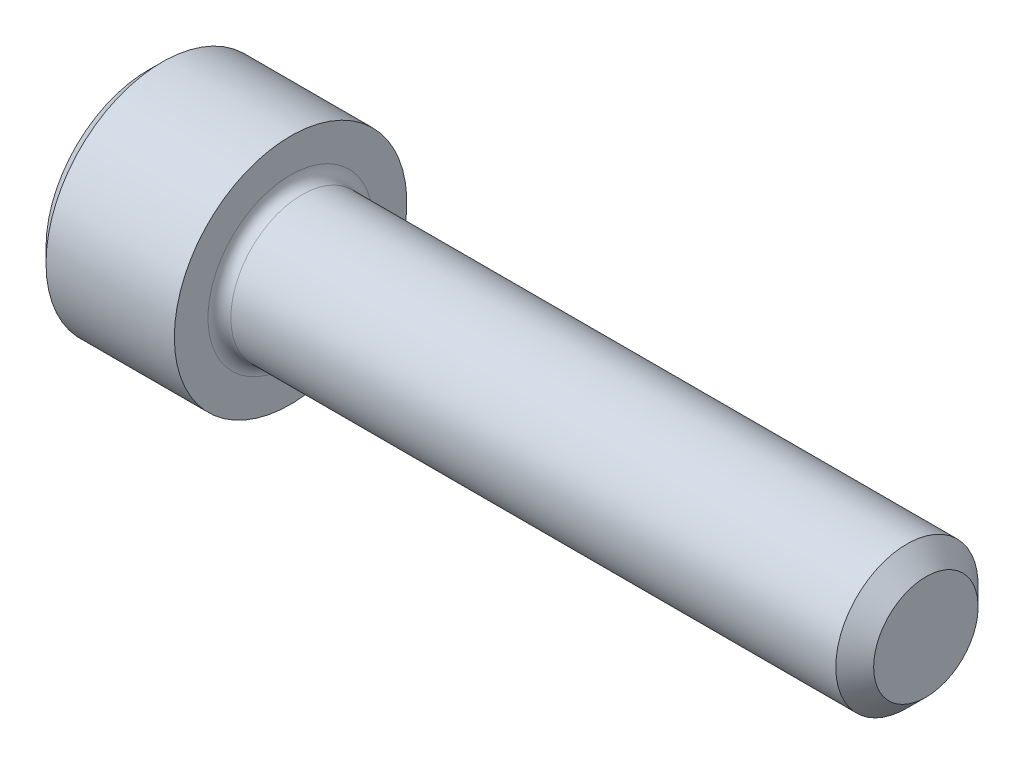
ISO-10303-21;
HEADER;
FILE_DESCRIPTION(('STEP AP214'),'2;1');
FILE_NAME('part.step','',(''),(''),'','','');
FILE_SCHEMA(('AUTOMOTIVE_DESIGN { 1 0 10303 214 1 1 1 1 }'));
ENDSEC;
DATA;
#1=APPLICATION_CONTEXT('core data for automotive mechanical design processes');
#2=APPLICATION_PROTOCOL_DEFINITION('international standard','automotive_design',2000,#1);
#3=PRODUCT_CONTEXT('',#1,'mechanical');
#4=PRODUCT('Part','Part','',(#3));
#5=PRODUCT_RELATED_PRODUCT_CATEGORY('part','',(#4));
#6=PRODUCT_DEFINITION_FORMATION('','',#4);
#7=PRODUCT_DEFINITION_CONTEXT('part definition',#1,'design');
#8=PRODUCT_DEFINITION('design','',#6,#7);
#9=PRODUCT_DEFINITION_SHAPE('','',#8);
#10=(LENGTH_UNIT() NAMED_UNIT(*) SI_UNIT(.MILLI.,.METRE.));
#11=(NAMED_UNIT(*) PLANE_ANGLE_UNIT() SI_UNIT($,.RADIAN.));
#12=(NAMED_UNIT(*) SI_UNIT($,.STERADIAN.) SOLID_ANGLE_UNIT());
#13=UNCERTAINTY_MEASURE_WITH_UNIT(LENGTH_MEASURE(1.E-05),#10,'distance_accuracy_value','');
#14=(GEOMETRIC_REPRESENTATION_CONTEXT(3) GLOBAL_UNCERTAINTY_ASSIGNED_CONTEXT((#13)) GLOBAL_UNIT_ASSIGNED_CONTEXT((#10,
#11,#12)) REPRESENTATION_CONTEXT('',''));
#15=CARTESIAN_POINT('',(0.,0.,0.));
#16=DIRECTION('',(0.,0.,1.));
#17=DIRECTION('',(1.,0.,0.));
#18=AXIS2_PLACEMENT_3D('',#15,#16,#17);
#19=CARTESIAN_POINT('',(0.,0.,0.));
#20=DIRECTION('',(-1.,0.,0.));
#21=DIRECTION('',(0.,0.,1.));
#22=AXIS2_PLACEMENT_3D('',#19,#20,#21);
#23=PLANE('',#22);
#24=DIRECTION('',(0.,-0.499999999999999,0.866025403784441));
#25=VECTOR('',#24,1.);
#26=CARTESIAN_POINT('',(0.,1.37848150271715,0.));
#27=LINE('',#26,#25);
#28=CARTESIAN_POINT('',(0.,1.37848150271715,0.));
#29=VERTEX_POINT('',#28);
#30=CARTESIAN_POINT('',(-2.08166817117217E-13,0.689240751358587,1.19379999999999));
#31=VERTEX_POINT('',#30);
#32=EDGE_CURVE('E114',#29,#31,#27,.T.);
#33=ORIENTED_EDGE('',*,*,#32,.T.);
#34=DIRECTION('',(0.,1.,0.));
#35=VECTOR('',#34,1.);
#36=CARTESIAN_POINT('',(-4.16333634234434E-13,-0.689240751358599,1.19379999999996));
#37=LINE('',#36,#35);
#38=CARTESIAN_POINT('',(-4.16333634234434E-13,-0.689240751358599,1.19379999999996));
#39=VERTEX_POINT('',#38);
#40=EDGE_CURVE('E103',#39,#31,#37,.T.);
#41=ORIENTED_EDGE('',*,*,#40,.F.);
#42=DIRECTION('',(0.,-0.500000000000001,-0.866025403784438));
#43=VECTOR('',#42,1.);
#44=CARTESIAN_POINT('',(-4.16333634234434E-13,-0.689240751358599,1.19379999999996));
#45=LINE('',#44,#43);
#46=CARTESIAN_POINT('',(0.,-1.37848150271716,0.));
#47=VERTEX_POINT('',#46);
#48=EDGE_CURVE('E113',#39,#47,#45,.T.);
#49=ORIENTED_EDGE('',*,*,#48,.T.);
#50=DIRECTION('',(0.,0.499999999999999,-0.86602540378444));
#51=VECTOR('',#50,1.);
#52=CARTESIAN_POINT('',(0.,-1.37848150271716,0.));
#53=LINE('',#52,#51);
#54=CARTESIAN_POINT('',(-2.08166817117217E-13,-0.689240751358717,-1.19380000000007));
#55=VERTEX_POINT('',#54);
#56=EDGE_CURVE('E132',#47,#55,#53,.T.);
#57=ORIENTED_EDGE('',*,*,#56,.T.);
#58=DIRECTION('',(0.,-1.,0.));
#59=VECTOR('',#58,1.);
#60=CARTESIAN_POINT('',(0.,0.689240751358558,-1.19380000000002));
#61=LINE('',#60,#59);
#62=CARTESIAN_POINT('',(0.,0.689240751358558,-1.19380000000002));
#63=VERTEX_POINT('',#62);
#64=EDGE_CURVE('E135',#63,#55,#61,.T.);
#65=ORIENTED_EDGE('',*,*,#64,.F.);
#66=DIRECTION('',(0.,-0.500000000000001,-0.866025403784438));
#67=VECTOR('',#66,1.);
#68=CARTESIAN_POINT('',(0.,1.37848150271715,0.));
#69=LINE('',#68,#67);
#70=EDGE_CURVE('E128',#29,#63,#69,.T.);
#71=ORIENTED_EDGE('',*,*,#70,.F.);
#72=EDGE_LOOP('',(#33,#41,#49,#57,#65,#71));
#73=FACE_BOUND('',#72,.T.);
#74=CARTESIAN_POINT('',(0.,0.,0.));
#75=DIRECTION('',(-1.,0.,0.));
#76=DIRECTION('',(0.,0.,1.));
#77=AXIS2_PLACEMENT_3D('',#74,#75,#76);
#78=CIRCLE('',#77,2.0447);
#79=CARTESIAN_POINT('',(0.,0.,2.0447));
#80=VERTEX_POINT('',#79);
#81=EDGE_CURVE('E186',#80,#80,#78,.T.);
#82=ORIENTED_EDGE('',*,*,#81,.T.);
#83=EDGE_LOOP('',(#82));
#84=FACE_BOUND('',#83,.T.);
#85=ADVANCED_FACE('F32',(#73,#84),#23,.T.);
#86=CARTESIAN_POINT('',(0.,0.,0.));
#87=DIRECTION('',(1.,0.,0.));
#88=DIRECTION('',(0.,0.,-1.));
#89=AXIS2_PLACEMENT_3D('',#86,#87,#88);
#90=CONICAL_SURFACE('',#89,2.0447,0.785398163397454);
#91=CARTESIAN_POINT('',(0.279399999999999,0.,0.));
#92=DIRECTION('',(-1.,0.,0.));
#93=DIRECTION('',(0.,0.,1.));
#94=AXIS2_PLACEMENT_3D('',#91,#92,#93);
#95=CIRCLE('',#94,2.3241);
#96=CARTESIAN_POINT('',(0.279399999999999,0.,2.32409999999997));
#97=VERTEX_POINT('',#96);
#98=EDGE_CURVE('E183',#97,#97,#95,.T.);
#99=ORIENTED_EDGE('',*,*,#98,.T.);
#100=EDGE_LOOP('',(#99));
#101=FACE_BOUND('',#100,.T.);
#102=ORIENTED_EDGE('',*,*,#81,.F.);
#103=EDGE_LOOP('',(#102));
#104=FACE_BOUND('',#103,.T.);
#105=ADVANCED_FACE('F210',(#101,#104),#90,.T.);
#106=CARTESIAN_POINT('',(-31.75,-1.21430643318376E-13,0.));
#107=DIRECTION('',(-1.,0.,0.));
#108=DIRECTION('',(0.,0.,1.));
#109=AXIS2_PLACEMENT_3D('',#106,#107,#108);
#110=CYLINDRICAL_SURFACE('',#109,2.3241);
#111=CARTESIAN_POINT('',(2.8448,-1.23165366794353E-13,0.));
#112=DIRECTION('',(-1.,0.,0.));
#113=DIRECTION('',(0.,0.,1.));
#114=AXIS2_PLACEMENT_3D('',#111,#112,#113);
#115=CIRCLE('',#114,2.3241);
#116=CARTESIAN_POINT('',(2.8448,-1.23165366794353E-13,2.32409999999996));
#117=VERTEX_POINT('',#116);
#118=EDGE_CURVE('E180',#117,#117,#115,.T.);
#119=ORIENTED_EDGE('',*,*,#118,.T.);
#120=EDGE_LOOP('',(#119));
#121=FACE_BOUND('',#120,.T.);
#122=ORIENTED_EDGE('',*,*,#98,.F.);
#123=EDGE_LOOP('',(#122));
#124=FACE_BOUND('',#123,.T.);
#125=ADVANCED_FACE('F214',(#121,#124),#110,.T.);
#126=CARTESIAN_POINT('',(2.84479999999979,2.3241,0.));
#127=DIRECTION('',(1.,0.,0.));
#128=DIRECTION('',(0.,0.,-1.));
#129=AXIS2_PLACEMENT_3D('',#126,#127,#128);
#130=PLANE('',#129);
#131=CARTESIAN_POINT('',(2.8448,-1.23165366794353E-13,0.));
#132=DIRECTION('',(1.,0.,0.));
#133=DIRECTION('',(0.,0.,-1.));
#134=AXIS2_PLACEMENT_3D('',#131,#132,#133);
#135=CIRCLE('',#134,1.651);
#136=CARTESIAN_POINT('',(2.8448,-1.23165366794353E-13,-1.65100000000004));
#137=VERTEX_POINT('',#136);
#138=EDGE_CURVE('E39',#137,#137,#135,.F.);
#139=ORIENTED_EDGE('',*,*,#138,.T.);
#140=EDGE_LOOP('',(#139));
#141=FACE_BOUND('',#140,.T.);
#142=ORIENTED_EDGE('',*,*,#118,.F.);
#143=EDGE_LOOP('',(#142));
#144=FACE_BOUND('',#143,.T.);
#145=ADVANCED_FACE('F191',(#141,#144),#130,.T.);
#146=CARTESIAN_POINT('',(-31.75,-1.21430643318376E-13,0.));
#147=DIRECTION('',(-1.,0.,0.));
#148=DIRECTION('',(0.,0.,1.));
#149=AXIS2_PLACEMENT_3D('',#146,#147,#148);
#150=CYLINDRICAL_SURFACE('',#149,1.4224);
#151=CARTESIAN_POINT('',(3.0734,0.,0.));
#152=DIRECTION('',(1.,0.,0.));
#153=DIRECTION('',(0.,0.,-1.));
#154=AXIS2_PLACEMENT_3D('',#151,#152,#153);
#155=CIRCLE('',#154,1.4224);
#156=CARTESIAN_POINT('',(3.0734,0.,-1.42240000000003));
#157=VERTEX_POINT('',#156);
#158=EDGE_CURVE('E11',#157,#157,#155,.T.);
#159=ORIENTED_EDGE('',*,*,#158,.T.);
#160=EDGE_LOOP('',(#159));
#161=FACE_BOUND('',#160,.T.);
#162=CARTESIAN_POINT('',(15.16634,0.,0.));
#163=DIRECTION('',(-1.,0.,0.));
#164=DIRECTION('',(0.,0.,1.));
#165=AXIS2_PLACEMENT_3D('',#162,#163,#164);
#166=CIRCLE('',#165,1.4224);
#167=CARTESIAN_POINT('',(15.16634,0.,1.42239999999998));
#168=VERTEX_POINT('',#167);
#169=EDGE_CURVE('E177',#168,#168,#166,.T.);
#170=ORIENTED_EDGE('',*,*,#169,.T.);
#171=EDGE_LOOP('',(#170));
#172=FACE_BOUND('',#171,.T.);
#173=ADVANCED_FACE('F225',(#161,#172),#150,.T.);
#174=CARTESIAN_POINT('',(15.5448,0.,0.));
#175=DIRECTION('',(-1.,0.,0.));
#176=DIRECTION('',(0.,0.,1.));
#177=AXIS2_PLACEMENT_3D('',#174,#175,#176);
#178=CONICAL_SURFACE('',#177,1.04394,0.785398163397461);
#179=ORIENTED_EDGE('',*,*,#169,.F.);
#180=EDGE_LOOP('',(#179));
#181=FACE_BOUND('',#180,.T.);
#182=CARTESIAN_POINT('',(15.5448,0.,0.));
#183=DIRECTION('',(-1.,0.,0.));
#184=DIRECTION('',(0.,0.,1.));
#185=AXIS2_PLACEMENT_3D('',#182,#183,#184);
#186=CIRCLE('',#185,1.04394);
#187=CARTESIAN_POINT('',(15.5448,0.,1.04393999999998));
#188=VERTEX_POINT('',#187);
#189=EDGE_CURVE('E173',#188,#188,#186,.T.);
#190=ORIENTED_EDGE('',*,*,#189,.T.);
#191=EDGE_LOOP('',(#190));
#192=FACE_BOUND('',#191,.T.);
#193=ADVANCED_FACE('F204',(#181,#192),#178,.T.);
#194=CARTESIAN_POINT('',(15.5447999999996,1.04393999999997,0.));
#195=DIRECTION('',(1.,0.,0.));
#196=DIRECTION('',(0.,0.,-1.));
#197=AXIS2_PLACEMENT_3D('',#194,#195,#196);
#198=PLANE('',#197);
#199=ORIENTED_EDGE('',*,*,#189,.F.);
#200=EDGE_LOOP('',(#199));
#201=FACE_BOUND('',#200,.T.);
#202=ADVANCED_FACE('F196',(#201),#198,.T.);
#203=CARTESIAN_POINT('',(3.0734,0.,0.));
#204=DIRECTION('',(1.,0.,0.));
#205=DIRECTION('',(0.,0.,-1.));
#206=AXIS2_PLACEMENT_3D('',#203,#204,#205);
#207=TOROIDAL_SURFACE('',#206,1.651,0.2286);
#208=ORIENTED_EDGE('',*,*,#158,.F.);
#209=EDGE_LOOP('',(#208));
#210=FACE_BOUND('',#209,.T.);
#211=ORIENTED_EDGE('',*,*,#138,.F.);
#212=EDGE_LOOP('',(#211));
#213=FACE_BOUND('',#212,.T.);
#214=ADVANCED_FACE('F194',(#210,#213),#207,.F.);
#215=CARTESIAN_POINT('',(1.2954,1.37848150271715,0.));
#216=DIRECTION('',(0.,-0.866025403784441,-0.499999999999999));
#217=DIRECTION('',(0.,0.499999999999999,-0.866025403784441));
#218=AXIS2_PLACEMENT_3D('',#215,#216,#217);
#219=PLANE('',#218);
#220=ORIENTED_EDGE('',*,*,#32,.F.);
#221=DIRECTION('',(-1.,0.,0.));
#222=VECTOR('',#221,1.);
#223=CARTESIAN_POINT('',(1.2954,1.37848150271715,0.));
#224=LINE('',#223,#222);
#225=CARTESIAN_POINT('',(1.2954,1.37848150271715,0.));
#226=VERTEX_POINT('',#225);
#227=EDGE_CURVE('E158',#226,#29,#224,.T.);
#228=ORIENTED_EDGE('',*,*,#227,.F.);
#229=DIRECTION('',(0.,-0.499999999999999,0.866025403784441));
#230=VECTOR('',#229,1.);
#231=CARTESIAN_POINT('',(1.2954,1.37848150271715,0.));
#232=LINE('',#231,#230);
#233=CARTESIAN_POINT('',(1.29540000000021,1.0338611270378,0.596899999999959));
#234=VERTEX_POINT('',#233);
#235=EDGE_CURVE('E138',#226,#234,#232,.T.);
#236=ORIENTED_EDGE('',*,*,#235,.T.);
#237=CARTESIAN_POINT('',(1.29539999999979,0.689240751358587,1.19379999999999));
#238=VERTEX_POINT('',#237);
#239=EDGE_CURVE('E122',#234,#238,#232,.T.);
#240=ORIENTED_EDGE('',*,*,#239,.T.);
#241=DIRECTION('',(-1.,0.,0.));
#242=VECTOR('',#241,1.);
#243=CARTESIAN_POINT('',(1.29539999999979,0.689240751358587,1.19379999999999));
#244=LINE('',#243,#242);
#245=EDGE_CURVE('E107',#238,#31,#244,.T.);
#246=ORIENTED_EDGE('',*,*,#245,.T.);
#247=EDGE_LOOP('',(#220,#228,#236,#240,#246));
#248=FACE_BOUND('',#247,.T.);
#249=ADVANCED_FACE('F118',(#248),#219,.T.);
#250=CARTESIAN_POINT('',(1.29539999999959,-0.689240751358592,1.19379999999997));
#251=DIRECTION('',(0.,0.,1.));
#252=DIRECTION('',(0.,-1.,0.));
#253=AXIS2_PLACEMENT_3D('',#250,#251,#252);
#254=PLANE('',#253);
#255=ORIENTED_EDGE('',*,*,#40,.T.);
#256=ORIENTED_EDGE('',*,*,#245,.F.);
#257=DIRECTION('',(0.,1.,0.));
#258=VECTOR('',#257,1.);
#259=CARTESIAN_POINT('',(1.29539999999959,-0.689240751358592,1.19379999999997));
#260=LINE('',#259,#258);
#261=CARTESIAN_POINT('',(1.2954,0.,1.19379999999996));
#262=VERTEX_POINT('',#261);
#263=EDGE_CURVE('E140',#262,#238,#260,.T.);
#264=ORIENTED_EDGE('',*,*,#263,.F.);
#265=CARTESIAN_POINT('',(1.29539999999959,-0.689240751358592,1.19379999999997));
#266=VERTEX_POINT('',#265);
#267=EDGE_CURVE('E141',#266,#262,#260,.T.);
#268=ORIENTED_EDGE('',*,*,#267,.F.);
#269=DIRECTION('',(-1.,0.,0.));
#270=VECTOR('',#269,1.);
#271=CARTESIAN_POINT('',(1.29539999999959,-0.689240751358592,1.19379999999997));
#272=LINE('',#271,#270);
#273=EDGE_CURVE('E109',#266,#39,#272,.T.);
#274=ORIENTED_EDGE('',*,*,#273,.T.);
#275=EDGE_LOOP('',(#255,#256,#264,#268,#274));
#276=FACE_BOUND('',#275,.T.);
#277=ADVANCED_FACE('F105',(#276),#254,.F.);
#278=CARTESIAN_POINT('',(1.29539999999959,-0.689240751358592,1.19379999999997));
#279=DIRECTION('',(0.,0.866025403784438,-0.500000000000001));
#280=DIRECTION('',(0.,0.500000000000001,0.866025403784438));
#281=AXIS2_PLACEMENT_3D('',#278,#279,#280);
#282=PLANE('',#281);
#283=ORIENTED_EDGE('',*,*,#48,.F.);
#284=ORIENTED_EDGE('',*,*,#273,.F.);
#285=DIRECTION('',(0.,-0.500000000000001,-0.866025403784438));
#286=VECTOR('',#285,1.);
#287=CARTESIAN_POINT('',(1.29539999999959,-0.689240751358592,1.19379999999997));
#288=LINE('',#287,#286);
#289=CARTESIAN_POINT('',(1.2954,-1.03386112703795,0.596899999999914));
#290=VERTEX_POINT('',#289);
#291=EDGE_CURVE('E145',#266,#290,#288,.T.);
#292=ORIENTED_EDGE('',*,*,#291,.T.);
#293=CARTESIAN_POINT('',(1.2954,-1.37848150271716,0.));
#294=VERTEX_POINT('',#293);
#295=EDGE_CURVE('E144',#290,#294,#288,.T.);
#296=ORIENTED_EDGE('',*,*,#295,.T.);
#297=DIRECTION('',(-1.,0.,0.));
#298=VECTOR('',#297,1.);
#299=CARTESIAN_POINT('',(1.2954,-1.37848150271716,0.));
#300=LINE('',#299,#298);
#301=EDGE_CURVE('E166',#294,#47,#300,.T.);
#302=ORIENTED_EDGE('',*,*,#301,.T.);
#303=EDGE_LOOP('',(#283,#284,#292,#296,#302));
#304=FACE_BOUND('',#303,.T.);
#305=ADVANCED_FACE('F264',(#304),#282,.T.);
#306=CARTESIAN_POINT('',(1.2954,-1.37848150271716,0.));
#307=DIRECTION('',(0.,0.86602540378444,0.499999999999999));
#308=DIRECTION('',(0.,-0.499999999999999,0.86602540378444));
#309=AXIS2_PLACEMENT_3D('',#306,#307,#308);
#310=PLANE('',#309);
#311=ORIENTED_EDGE('',*,*,#56,.F.);
#312=ORIENTED_EDGE('',*,*,#301,.F.);
#313=DIRECTION('',(0.,0.499999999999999,-0.86602540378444));
#314=VECTOR('',#313,1.);
#315=CARTESIAN_POINT('',(1.2954,-1.37848150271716,0.));
#316=LINE('',#315,#314);
#317=CARTESIAN_POINT('',(1.29539999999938,-1.03386112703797,-0.596900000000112));
#318=VERTEX_POINT('',#317);
#319=EDGE_CURVE('E149',#294,#318,#316,.T.);
#320=ORIENTED_EDGE('',*,*,#319,.T.);
#321=CARTESIAN_POINT('',(1.29539999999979,-0.689240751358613,-1.19380000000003));
#322=VERTEX_POINT('',#321);
#323=EDGE_CURVE('E148',#318,#322,#316,.T.);
#324=ORIENTED_EDGE('',*,*,#323,.T.);
#325=DIRECTION('',(-1.,0.,0.));
#326=VECTOR('',#325,1.);
#327=CARTESIAN_POINT('',(1.29539999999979,-0.689240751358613,-1.19380000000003));
#328=LINE('',#327,#326);
#329=EDGE_CURVE('E163',#322,#55,#328,.T.);
#330=ORIENTED_EDGE('',*,*,#329,.T.);
#331=EDGE_LOOP('',(#311,#312,#320,#324,#330));
#332=FACE_BOUND('',#331,.T.);
#333=ADVANCED_FACE('F273',(#332),#310,.T.);
#334=CARTESIAN_POINT('',(1.2954,0.689240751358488,-1.19380000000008));
#335=DIRECTION('',(0.,0.,-1.));
#336=DIRECTION('',(0.,1.,0.));
#337=AXIS2_PLACEMENT_3D('',#334,#335,#336);
#338=PLANE('',#337);
#339=ORIENTED_EDGE('',*,*,#64,.T.);
#340=ORIENTED_EDGE('',*,*,#329,.F.);
#341=DIRECTION('',(0.,-1.,0.));
#342=VECTOR('',#341,1.);
#343=CARTESIAN_POINT('',(1.2954,0.689240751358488,-1.19380000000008));
#344=LINE('',#343,#342);
#345=CARTESIAN_POINT('',(1.2954,0.,-1.19380000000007));
#346=VERTEX_POINT('',#345);
#347=EDGE_CURVE('E152',#346,#322,#344,.T.);
#348=ORIENTED_EDGE('',*,*,#347,.F.);
#349=CARTESIAN_POINT('',(1.2954,0.689240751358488,-1.19380000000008));
#350=VERTEX_POINT('',#349);
#351=EDGE_CURVE('E46',#350,#346,#344,.T.);
#352=ORIENTED_EDGE('',*,*,#351,.F.);
#353=DIRECTION('',(-1.,0.,0.));
#354=VECTOR('',#353,1.);
#355=CARTESIAN_POINT('',(1.2954,0.689240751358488,-1.19380000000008));
#356=LINE('',#355,#354);
#357=EDGE_CURVE('E160',#350,#63,#356,.T.);
#358=ORIENTED_EDGE('',*,*,#357,.T.);
#359=EDGE_LOOP('',(#339,#340,#348,#352,#358));
#360=FACE_BOUND('',#359,.T.);
#361=ADVANCED_FACE('F283',(#360),#338,.F.);
#362=CARTESIAN_POINT('',(1.2954,1.37848150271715,0.));
#363=DIRECTION('',(0.,0.866025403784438,-0.500000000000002));
#364=DIRECTION('',(0.,0.500000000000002,0.866025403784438));
#365=AXIS2_PLACEMENT_3D('',#362,#363,#364);
#366=PLANE('',#365);
#367=ORIENTED_EDGE('',*,*,#70,.T.);
#368=ORIENTED_EDGE('',*,*,#357,.F.);
#369=DIRECTION('',(0.,-0.500000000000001,-0.866025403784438));
#370=VECTOR('',#369,1.);
#371=CARTESIAN_POINT('',(1.2954,1.37848150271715,0.));
#372=LINE('',#371,#370);
#373=CARTESIAN_POINT('',(1.2954,1.03386112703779,-0.596900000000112));
#374=VERTEX_POINT('',#373);
#375=EDGE_CURVE('E154',#374,#350,#372,.T.);
#376=ORIENTED_EDGE('',*,*,#375,.F.);
#377=EDGE_CURVE('E155',#226,#374,#372,.T.);
#378=ORIENTED_EDGE('',*,*,#377,.F.);
#379=ORIENTED_EDGE('',*,*,#227,.T.);
#380=EDGE_LOOP('',(#367,#368,#376,#378,#379));
#381=FACE_BOUND('',#380,.T.);
#382=ADVANCED_FACE('F293',(#381),#366,.F.);
#383=CARTESIAN_POINT('',(1.2954,2.06772225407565,-1.19380000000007));
#384=DIRECTION('',(1.,0.,0.));
#385=DIRECTION('',(0.,0.,-1.));
#386=AXIS2_PLACEMENT_3D('',#383,#384,#385);
#387=PLANE('',#386);
#388=ORIENTED_EDGE('',*,*,#347,.T.);
#389=ORIENTED_EDGE('',*,*,#323,.F.);
#390=CARTESIAN_POINT('',(1.2954,0.,0.));
#391=DIRECTION('',(-1.,0.,0.));
#392=DIRECTION('',(0.,0.,1.));
#393=AXIS2_PLACEMENT_3D('',#390,#391,#392);
#394=CIRCLE('',#393,1.1938);
#395=EDGE_CURVE('E404',#346,#318,#394,.T.);
#396=ORIENTED_EDGE('',*,*,#395,.F.);
#397=EDGE_LOOP('',(#388,#389,#396));
#398=FACE_BOUND('',#397,.T.);
#399=ADVANCED_FACE('F303',(#398),#387,.F.);
#400=ORIENTED_EDGE('',*,*,#319,.F.);
#401=ORIENTED_EDGE('',*,*,#295,.F.);
#402=EDGE_CURVE('E402',#318,#290,#394,.T.);
#403=ORIENTED_EDGE('',*,*,#402,.F.);
#404=EDGE_LOOP('',(#400,#401,#403));
#405=FACE_BOUND('',#404,.T.);
#406=ADVANCED_FACE('F313',(#405),#387,.F.);
#407=ORIENTED_EDGE('',*,*,#291,.F.);
#408=ORIENTED_EDGE('',*,*,#267,.T.);
#409=EDGE_CURVE('E123',#290,#262,#394,.T.);
#410=ORIENTED_EDGE('',*,*,#409,.F.);
#411=EDGE_LOOP('',(#407,#408,#410));
#412=FACE_BOUND('',#411,.T.);
#413=ADVANCED_FACE('F324',(#412),#387,.F.);
#414=ORIENTED_EDGE('',*,*,#263,.T.);
#415=ORIENTED_EDGE('',*,*,#239,.F.);
#416=EDGE_CURVE('E170',#262,#234,#394,.T.);
#417=ORIENTED_EDGE('',*,*,#416,.F.);
#418=EDGE_LOOP('',(#414,#415,#417));
#419=FACE_BOUND('',#418,.T.);
#420=ADVANCED_FACE('F333',(#419),#387,.F.);
#421=ORIENTED_EDGE('',*,*,#235,.F.);
#422=ORIENTED_EDGE('',*,*,#377,.T.);
#423=EDGE_CURVE('E174',#234,#374,#394,.T.);
#424=ORIENTED_EDGE('',*,*,#423,.F.);
#425=EDGE_LOOP('',(#421,#422,#424));
#426=FACE_BOUND('',#425,.T.);
#427=ADVANCED_FACE('F342',(#426),#387,.F.);
#428=ORIENTED_EDGE('',*,*,#375,.T.);
#429=ORIENTED_EDGE('',*,*,#351,.T.);
#430=EDGE_CURVE('E407',#374,#346,#394,.T.);
#431=ORIENTED_EDGE('',*,*,#430,.F.);
#432=EDGE_LOOP('',(#428,#429,#431));
#433=FACE_BOUND('',#432,.T.);
#434=ADVANCED_FACE('F316',(#433),#387,.F.);
#435=CARTESIAN_POINT('',(1.2954,0.,0.));
#436=DIRECTION('',(-1.,0.,0.));
#437=DIRECTION('',(0.,0.,1.));
#438=AXIS2_PLACEMENT_3D('',#435,#436,#437);
#439=CONICAL_SURFACE('',#438,1.1938,1.04719755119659);
#440=CARTESIAN_POINT('',(1.98464075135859,0.,0.));
#441=VERTEX_POINT('',#440);
#442=VERTEX_LOOP('',#441);
#443=FACE_BOUND('',#442,.T.);
#444=ORIENTED_EDGE('',*,*,#416,.T.);
#445=ORIENTED_EDGE('',*,*,#423,.T.);
#446=ORIENTED_EDGE('',*,*,#430,.T.);
#447=ORIENTED_EDGE('',*,*,#395,.T.);
#448=ORIENTED_EDGE('',*,*,#402,.T.);
#449=ORIENTED_EDGE('',*,*,#409,.T.);
#450=EDGE_LOOP('',(#444,#445,#446,#447,#448,#449));
#451=FACE_BOUND('',#450,.T.);
#452=ADVANCED_FACE('F359',(#443,#451),#439,.F.);
#453=CLOSED_SHELL('',(#85,#105,#125,#145,#173,#193,#202,#214,#249,#277,#305,#333,#361,#382,#399,
#406,#413,#420,#427,#434,#452));
#454=MANIFOLD_SOLID_BREP('B2',#453);
#455=ADVANCED_BREP_SHAPE_REPRESENTATION('',(#18,#454),#14);
#456=SHAPE_DEFINITION_REPRESENTATION(#9,#455);
ENDSEC;
END-ISO-10303-21;
